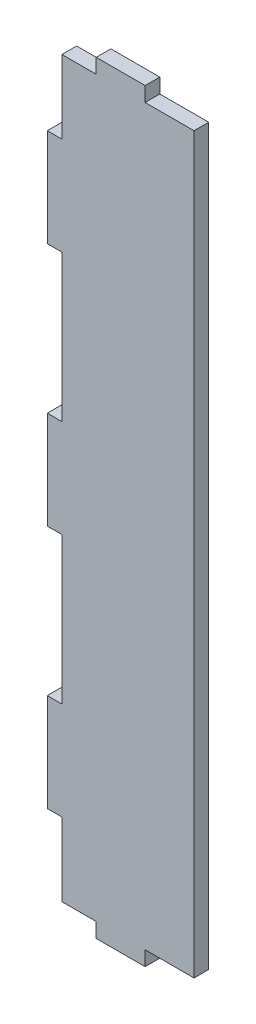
from build123d import *

# Parameters (mm, degrees)
SKETCH_1_W          = 30
SKETCH_1_H          = 150
EXTRUDE_1_DEPTH     = 3
SKETCH_2_W          = 10
SKETCH_2_H          = 3
EXTRUDE_2_DEPTH     = 3
SKETCH_3_W          = 3
SKETCH_3_H          = 30
SKETCH_3_H_2        = 15
CUT_EXTRUDE_1_DEPTH = 3


with BuildPart() as part:
    # Sketch 1 → Extrude 1 (new body)
    with BuildSketch(Plane.XY):
        Rectangle(SKETCH_1_W, SKETCH_1_H)
    extrude(amount=EXTRUDE_1_DEPTH)

    # Sketch 2 → Extrude 2 (add)
    with BuildSketch(Plane.XY):
        with Locations((0, 76.5)):
            Rectangle(SKETCH_2_W, SKETCH_2_H)
        with Locations((0, -76.5)):
            Rectangle(SKETCH_2_W, SKETCH_2_H)
    extrude(amount=EXTRUDE_2_DEPTH)

    # Sketch 3 → Cut-Extrude 1 (cut)
    with BuildSketch(Plane.XY.offset(3)):
        with Locations((-13.5, -25)):
            Rectangle(SKETCH_3_W, SKETCH_3_H)
        with Locations((-13.5, 67.5)):
            Rectangle(SKETCH_3_W, SKETCH_3_H_2)
        with Locations((-13.5, 25)):
            Rectangle(SKETCH_3_W, SKETCH_3_H)
        with Locations((-13.5, -67.5)):
            Rectangle(SKETCH_3_W, SKETCH_3_H_2)
    extrude(amount=-CUT_EXTRUDE_1_DEPTH, mode=Mode.SUBTRACT)


solid = part.part
